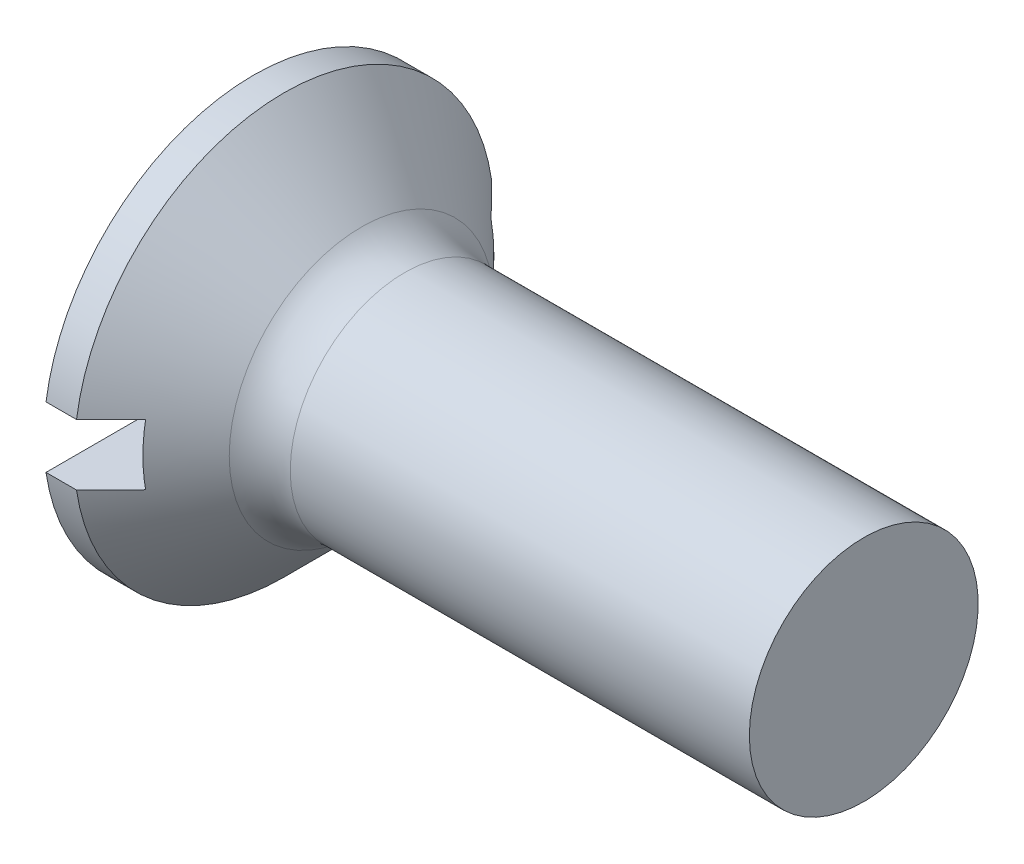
ISO-10303-21;
HEADER;
FILE_DESCRIPTION(('STEP AP214'),'2;1');
FILE_NAME('part.step','',(''),(''),'','','');
FILE_SCHEMA(('AUTOMOTIVE_DESIGN { 1 0 10303 214 1 1 1 1 }'));
ENDSEC;
DATA;
#1=APPLICATION_CONTEXT('core data for automotive mechanical design processes');
#2=APPLICATION_PROTOCOL_DEFINITION('international standard','automotive_design',2000,#1);
#3=PRODUCT_CONTEXT('',#1,'mechanical');
#4=PRODUCT('Part','Part','',(#3));
#5=PRODUCT_RELATED_PRODUCT_CATEGORY('part','',(#4));
#6=PRODUCT_DEFINITION_FORMATION('','',#4);
#7=PRODUCT_DEFINITION_CONTEXT('part definition',#1,'design');
#8=PRODUCT_DEFINITION('design','',#6,#7);
#9=PRODUCT_DEFINITION_SHAPE('','',#8);
#10=(LENGTH_UNIT() NAMED_UNIT(*) SI_UNIT(.MILLI.,.METRE.));
#11=(NAMED_UNIT(*) PLANE_ANGLE_UNIT() SI_UNIT($,.RADIAN.));
#12=(NAMED_UNIT(*) SI_UNIT($,.STERADIAN.) SOLID_ANGLE_UNIT());
#13=UNCERTAINTY_MEASURE_WITH_UNIT(LENGTH_MEASURE(1.E-05),#10,'distance_accuracy_value','');
#14=(GEOMETRIC_REPRESENTATION_CONTEXT(3) GLOBAL_UNCERTAINTY_ASSIGNED_CONTEXT((#13)) GLOBAL_UNIT_ASSIGNED_CONTEXT((#10,
#11,#12)) REPRESENTATION_CONTEXT('',''));
#15=CARTESIAN_POINT('',(0.,0.,0.));
#16=DIRECTION('',(0.,0.,1.));
#17=DIRECTION('',(1.,0.,0.));
#18=AXIS2_PLACEMENT_3D('',#15,#16,#17);
#19=CARTESIAN_POINT('',(-6.34999999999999,0.,0.));
#20=DIRECTION('',(-1.,0.,0.));
#21=DIRECTION('',(0.,0.,1.));
#22=AXIS2_PLACEMENT_3D('',#19,#20,#21);
#23=CYLINDRICAL_SURFACE('',#22,2.75);
#24=DIRECTION('',(-1.,0.,0.));
#25=VECTOR('',#24,1.);
#26=CARTESIAN_POINT('',(-6.34999999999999,0.4,-2.72075357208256));
#27=LINE('',#26,#25);
#28=CARTESIAN_POINT('',(0.,0.4,-2.72075357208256));
#29=VERTEX_POINT('',#28);
#30=CARTESIAN_POINT('',(0.400000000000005,0.4,-2.72075357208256));
#31=VERTEX_POINT('',#30);
#32=EDGE_CURVE('E56',#29,#31,#27,.F.);
#33=ORIENTED_EDGE('',*,*,#32,.F.);
#34=CARTESIAN_POINT('',(0.,0.,0.));
#35=DIRECTION('',(-1.,0.,0.));
#36=DIRECTION('',(0.,0.,1.));
#37=AXIS2_PLACEMENT_3D('',#34,#35,#36);
#38=CIRCLE('',#37,2.75);
#39=CARTESIAN_POINT('',(0.,0.4,2.72075357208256));
#40=VERTEX_POINT('',#39);
#41=EDGE_CURVE('E104',#40,#29,#38,.T.);
#42=ORIENTED_EDGE('',*,*,#41,.F.);
#43=DIRECTION('',(-1.,0.,0.));
#44=VECTOR('',#43,1.);
#45=CARTESIAN_POINT('',(-6.34999999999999,0.4,2.72075357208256));
#46=LINE('',#45,#44);
#47=CARTESIAN_POINT('',(0.400000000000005,0.4,2.72075357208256));
#48=VERTEX_POINT('',#47);
#49=EDGE_CURVE('E161',#48,#40,#46,.T.);
#50=ORIENTED_EDGE('',*,*,#49,.F.);
#51=CARTESIAN_POINT('',(0.400000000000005,0.,0.));
#52=DIRECTION('',(-1.,0.,0.));
#53=DIRECTION('',(0.,0.,1.));
#54=AXIS2_PLACEMENT_3D('',#51,#52,#53);
#55=CIRCLE('',#54,2.75);
#56=EDGE_CURVE('E113',#48,#31,#55,.T.);
#57=ORIENTED_EDGE('',*,*,#56,.T.);
#58=EDGE_LOOP('',(#33,#42,#50,#57));
#59=FACE_BOUND('',#58,.T.);
#60=ADVANCED_FACE('F33',(#59),#23,.T.);
#61=CARTESIAN_POINT('',(0.,0.,0.));
#62=DIRECTION('',(-1.,0.,0.));
#63=DIRECTION('',(0.,0.,1.));
#64=AXIS2_PLACEMENT_3D('',#61,#62,#63);
#65=PLANE('',#64);
#66=DIRECTION('',(0.,0.,-1.));
#67=VECTOR('',#66,1.);
#68=CARTESIAN_POINT('',(0.,0.4,0.));
#69=LINE('',#68,#67);
#70=EDGE_CURVE('E91',#40,#29,#69,.T.);
#71=ORIENTED_EDGE('',*,*,#70,.F.);
#72=ORIENTED_EDGE('',*,*,#41,.T.);
#73=EDGE_LOOP('',(#71,#72));
#74=FACE_BOUND('',#73,.T.);
#75=ADVANCED_FACE('F167',(#74),#65,.T.);
#76=CARTESIAN_POINT('',(8.,1.5,0.));
#77=DIRECTION('',(1.,0.,0.));
#78=DIRECTION('',(0.,0.,-1.));
#79=AXIS2_PLACEMENT_3D('',#76,#77,#78);
#80=PLANE('',#79);
#81=CARTESIAN_POINT('',(8.,0.,0.));
#82=DIRECTION('',(-1.,0.,0.));
#83=DIRECTION('',(0.,0.,1.));
#84=AXIS2_PLACEMENT_3D('',#81,#82,#83);
#85=CIRCLE('',#84,1.5);
#86=CARTESIAN_POINT('',(8.,0.,1.5));
#87=VERTEX_POINT('',#86);
#88=EDGE_CURVE('E114',#87,#87,#85,.T.);
#89=ORIENTED_EDGE('',*,*,#88,.F.);
#90=EDGE_LOOP('',(#89));
#91=FACE_BOUND('',#90,.T.);
#92=ADVANCED_FACE('F169',(#91),#80,.T.);
#93=CARTESIAN_POINT('',(-6.34999999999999,0.,0.));
#94=DIRECTION('',(-1.,0.,0.));
#95=DIRECTION('',(0.,0.,1.));
#96=AXIS2_PLACEMENT_3D('',#93,#94,#95);
#97=CYLINDRICAL_SURFACE('',#96,1.5);
#98=CARTESIAN_POINT('',(1.98137084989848,0.,0.));
#99=DIRECTION('',(-1.,0.,0.));
#100=DIRECTION('',(0.,0.,1.));
#101=AXIS2_PLACEMENT_3D('',#98,#99,#100);
#102=CIRCLE('',#101,1.5);
#103=CARTESIAN_POINT('',(1.98137084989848,0.,1.5));
#104=VERTEX_POINT('',#103);
#105=EDGE_CURVE('E92',#104,#104,#102,.F.);
#106=ORIENTED_EDGE('',*,*,#105,.T.);
#107=EDGE_LOOP('',(#106));
#108=FACE_BOUND('',#107,.T.);
#109=ORIENTED_EDGE('',*,*,#88,.T.);
#110=EDGE_LOOP('',(#109));
#111=FACE_BOUND('',#110,.T.);
#112=ADVANCED_FACE('F174',(#108,#111),#97,.T.);
#113=CARTESIAN_POINT('',(0.400000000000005,0.,0.));
#114=DIRECTION('',(-1.,0.,0.));
#115=DIRECTION('',(0.,0.,1.));
#116=AXIS2_PLACEMENT_3D('',#113,#114,#115);
#117=CONICAL_SURFACE('',#116,2.75,0.78539816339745);
#118=CARTESIAN_POINT('',(-2.91122703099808,0.399999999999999,-6.04801398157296));
#119=CARTESIAN_POINT('',(-2.70333669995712,0.399999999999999,-5.83966573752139));
#120=CARTESIAN_POINT('',(-2.49546630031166,0.399999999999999,-5.63129758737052));
#121=CARTESIAN_POINT('',(-2.07978706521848,0.399999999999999,-5.2144912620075));
#122=CARTESIAN_POINT('',(-1.87197823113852,0.399999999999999,-5.00605308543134));
#123=CARTESIAN_POINT('',(-1.45635477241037,0.399999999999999,-4.58898711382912));
#124=CARTESIAN_POINT('',(-1.2485401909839,0.399999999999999,-4.38035927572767));
#125=CARTESIAN_POINT('',(-0.833054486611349,0.399999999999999,-3.96296915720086));
#126=CARTESIAN_POINT('',(-0.625383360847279,0.399999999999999,-3.75420687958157));
#127=CARTESIAN_POINT('',(-0.208177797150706,0.399999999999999,-3.33435396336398));
#128=CARTESIAN_POINT('',(0.00135434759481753,0.4,-3.12326104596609));
#129=CARTESIAN_POINT('',(0.420030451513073,0.4,-2.70066518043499));
#130=CARTESIAN_POINT('',(0.629174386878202,0.4,-2.48916220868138));
#131=CARTESIAN_POINT('',(0.942224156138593,0.4,-2.1713129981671));
#132=CARTESIAN_POINT('',(1.04644766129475,0.4,-2.06527989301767));
#133=CARTESIAN_POINT('',(1.25455725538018,0.4,-1.85287805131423));
#134=CARTESIAN_POINT('',(1.35844333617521,0.4,-1.7465093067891));
#135=CARTESIAN_POINT('',(1.56564763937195,0.4,-1.53324094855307));
#136=CARTESIAN_POINT('',(1.66896592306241,0.4,-1.42634139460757));
#137=CARTESIAN_POINT('',(1.82313895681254,0.4,-1.26522565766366));
#138=CARTESIAN_POINT('',(1.87439491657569,0.4,-1.21139372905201));
#139=CARTESIAN_POINT('',(1.9765104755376,0.4,-1.10335558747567));
#140=CARTESIAN_POINT('',(2.02737008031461,0.4,-1.04914937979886));
#141=CARTESIAN_POINT('',(2.10536761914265,0.4,-0.965078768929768));
#142=CARTESIAN_POINT('',(2.13272119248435,0.4,-0.935414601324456));
#143=CARTESIAN_POINT('',(2.18719151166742,0.4,-0.875868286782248));
#144=CARTESIAN_POINT('',(2.21430825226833,0.4,-0.845986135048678));
#145=CARTESIAN_POINT('',(2.26822565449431,0.4,-0.785940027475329));
#146=CARTESIAN_POINT('',(2.29502633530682,0.4,-0.755776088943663));
#147=CARTESIAN_POINT('',(2.34818681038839,0.4,-0.695065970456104));
#148=CARTESIAN_POINT('',(2.37454662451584,0.4,-0.664519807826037));
#149=CARTESIAN_POINT('',(2.43976155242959,0.4,-0.587422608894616));
#150=CARTESIAN_POINT('',(2.4782379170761,0.4,-0.540543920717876));
#151=CARTESIAN_POINT('',(2.53401321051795,0.4,-0.468681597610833));
#152=CARTESIAN_POINT('',(2.55228877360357,0.4,-0.444459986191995));
#153=CARTESIAN_POINT('',(2.5878711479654,0.4,-0.39531915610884));
#154=CARTESIAN_POINT('',(2.60517823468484,0.4,-0.370400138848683));
#155=CARTESIAN_POINT('',(2.64157672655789,0.4,-0.314684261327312));
#156=CARTESIAN_POINT('',(2.66036306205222,0.4,-0.28368484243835));
#157=CARTESIAN_POINT('',(2.69440764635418,0.4,-0.219761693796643));
#158=CARTESIAN_POINT('',(2.70967206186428,0.4,-0.186841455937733));
#159=CARTESIAN_POINT('',(2.73016014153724,0.4,-0.129375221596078));
#160=CARTESIAN_POINT('',(2.73703138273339,0.4,-0.105439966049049));
#161=CARTESIAN_POINT('',(2.74668434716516,0.4,-0.0567945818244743));
#162=CARTESIAN_POINT('',(2.74948035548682,0.4,-0.0320874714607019));
#163=CARTESIAN_POINT('',(2.75038742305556,0.4,0.0175418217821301));
#164=CARTESIAN_POINT('',(2.74847509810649,0.4,0.0424644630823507));
#165=CARTESIAN_POINT('',(2.7403655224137,0.4,0.0916234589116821));
#166=CARTESIAN_POINT('',(2.73415677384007,0.4,0.115857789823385));
#167=CARTESIAN_POINT('',(2.71827371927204,0.4,0.164097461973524));
#168=CARTESIAN_POINT('',(2.70848082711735,0.4,0.188061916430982));
#169=CARTESIAN_POINT('',(2.68657810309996,0.4,0.234925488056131));
#170=CARTESIAN_POINT('',(2.67446406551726,0.4,0.257822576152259));
#171=CARTESIAN_POINT('',(2.64859519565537,0.4,0.302903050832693));
#172=CARTESIAN_POINT('',(2.63482775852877,0.4,0.325079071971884));
#173=CARTESIAN_POINT('',(2.60624001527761,0.4,0.368705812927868));
#174=CARTESIAN_POINT('',(2.59142061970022,0.4,0.390157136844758));
#175=CARTESIAN_POINT('',(2.54324495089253,0.4,0.457380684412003));
#176=CARTESIAN_POINT('',(2.5085311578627,0.4,0.502172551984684));
#177=CARTESIAN_POINT('',(2.4373574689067,0.4,0.590355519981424));
#178=CARTESIAN_POINT('',(2.40089644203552,0.4,0.633745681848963));
#179=CARTESIAN_POINT('',(2.32688330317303,0.4,0.719722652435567));
#180=CARTESIAN_POINT('',(2.28932931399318,0.4,0.762307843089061));
#181=CARTESIAN_POINT('',(2.21358878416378,0.4,0.846885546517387));
#182=CARTESIAN_POINT('',(2.17540243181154,0.4,0.888878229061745));
#183=CARTESIAN_POINT('',(2.06044068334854,0.4,1.01402227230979));
#184=CARTESIAN_POINT('',(1.98303698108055,0.4,1.09659540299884));
#185=CARTESIAN_POINT('',(1.82747335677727,0.4,1.26085212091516));
#186=CARTESIAN_POINT('',(1.74931433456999,0.4,1.34253656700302));
#187=CARTESIAN_POINT('',(1.59286602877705,0.4,1.50504082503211));
#188=CARTESIAN_POINT('',(1.51457909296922,0.4,1.58586289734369));
#189=CARTESIAN_POINT('',(1.35769196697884,0.4,1.74720261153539));
#190=CARTESIAN_POINT('',(1.27909177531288,0.4,1.82772025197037));
#191=CARTESIAN_POINT('',(1.04297819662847,0.4,2.06897290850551));
#192=CARTESIAN_POINT('',(0.885154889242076,0.4,2.22940447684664));
#193=CARTESIAN_POINT('',(0.569022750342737,0.4,2.54992542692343));
#194=CARTESIAN_POINT('',(0.410713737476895,0.4,2.71001462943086));
#195=CARTESIAN_POINT('',(0.093846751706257,0.4,3.02994348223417));
#196=CARTESIAN_POINT('',(-0.0647112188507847,0.4,3.18978313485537));
#197=CARTESIAN_POINT('',(-0.540591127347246,0.4,3.66904928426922));
#198=CARTESIAN_POINT('',(-0.858143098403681,0.400000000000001,3.98824727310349));
#199=CARTESIAN_POINT('',(-1.49349686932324,0.400000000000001,4.62632608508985));
#200=CARTESIAN_POINT('',(-1.81129863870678,0.400000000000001,4.94520693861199));
#201=CARTESIAN_POINT('',(-2.25950055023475,0.400000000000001,5.39470040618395));
#202=CARTESIAN_POINT('',(-2.38983276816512,0.400000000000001,5.5253807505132));
#203=CARTESIAN_POINT('',(-2.65051602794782,0.400000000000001,5.78671502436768));
#204=CARTESIAN_POINT('',(-2.78086706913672,0.400000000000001,5.91736895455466));
#205=CARTESIAN_POINT('',(-2.91122703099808,0.400000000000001,6.04801398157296));
#206=B_SPLINE_CURVE_WITH_KNOTS('',3,(#118,#119,#120,#121,#122,#123,#124,#125,#126,#127,#128,
#129,#130,#131,#132,#133,#134,#135,#136,#137,#138,#139,#140,#141,#142,#143,#144,#145,#146,#147,
#148,#149,#150,#151,#152,#153,#154,#155,#156,#157,#158,#159,#160,#161,#162,#163,#164,#165,#166,
#167,#168,#169,#170,#171,#172,#173,#174,#175,#176,#177,#178,#179,#180,#181,#182,#183,#184,#185,
#186,#187,#188,#189,#190,#191,#192,#193,#194,#195,#196,#197,#198,#199,#200,#201,#202,#203,#204,
#205),.UNSPECIFIED.,.F.,.F.,(4,2,2,2,2,2,2,2,2,2,2,2,2,2,2,2,2,2,2,2,2,2,2,2,2,2,2,2,2,2,2,2,2,
2,2,2,2,2,2,2,2,2,2,4),(0.,0.882975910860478,1.76597015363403,2.64937958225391,3.53277113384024,
4.42505762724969,5.31739714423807,5.76343472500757,6.20948297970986,6.65548210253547,
6.87847301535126,7.10146078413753,7.22251193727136,7.34356576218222,7.46461219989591,
7.58565317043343,7.7675312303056,7.85854400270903,7.94953075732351,8.05816632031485,
8.16661019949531,8.24105170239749,8.31523162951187,8.38978071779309,8.46453008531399,
8.54201686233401,8.61964538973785,8.69790858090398,8.77610483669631,8.94600506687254,
9.11601679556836,9.28634010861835,9.45661358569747,9.79613758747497,10.1352975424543,
10.4728599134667,10.8104238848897,11.4855651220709,12.1610000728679,12.8364286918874,
14.1871833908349,15.5377930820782,16.0914848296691,16.6451603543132),.UNSPECIFIED.);
#207=CARTESIAN_POINT('',(0.85,0.4,-2.26495033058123));
#208=VERTEX_POINT('',#207);
#209=EDGE_CURVE('E105',#31,#208,#206,.T.);
#210=ORIENTED_EDGE('',*,*,#209,.F.);
#211=ORIENTED_EDGE('',*,*,#56,.F.);
#212=CARTESIAN_POINT('',(0.85,0.4,2.26495033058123));
#213=VERTEX_POINT('',#212);
#214=EDGE_CURVE('E109',#213,#48,#206,.T.);
#215=ORIENTED_EDGE('',*,*,#214,.F.);
#216=CARTESIAN_POINT('',(0.85,0.,0.));
#217=DIRECTION('',(-1.,0.,0.));
#218=DIRECTION('',(0.,0.,1.));
#219=AXIS2_PLACEMENT_3D('',#216,#217,#218);
#220=CIRCLE('',#219,2.3);
#221=CARTESIAN_POINT('',(0.85,-0.400000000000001,2.26495033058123));
#222=VERTEX_POINT('',#221);
#223=EDGE_CURVE('E37',#213,#222,#220,.F.);
#224=ORIENTED_EDGE('',*,*,#223,.T.);
#225=CARTESIAN_POINT('',(-2.91122703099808,-0.400000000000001,6.04801398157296));
#226=CARTESIAN_POINT('',(-2.70333669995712,-0.400000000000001,5.83966573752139));
#227=CARTESIAN_POINT('',(-2.49546630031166,-0.400000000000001,5.63129758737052));
#228=CARTESIAN_POINT('',(-2.07978706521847,-0.400000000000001,5.2144912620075));
#229=CARTESIAN_POINT('',(-1.87197823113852,-0.400000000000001,5.00605308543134));
#230=CARTESIAN_POINT('',(-1.45635477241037,-0.400000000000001,4.58898711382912));
#231=CARTESIAN_POINT('',(-1.2485401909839,-0.400000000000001,4.38035927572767));
#232=CARTESIAN_POINT('',(-0.833054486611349,-0.400000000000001,3.96296915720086));
#233=CARTESIAN_POINT('',(-0.625383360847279,-0.400000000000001,3.75420687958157));
#234=CARTESIAN_POINT('',(-0.208177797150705,-0.400000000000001,3.33435396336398));
#235=CARTESIAN_POINT('',(0.00135434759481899,-0.400000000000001,3.12326104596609));
#236=CARTESIAN_POINT('',(0.420030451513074,-0.400000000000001,2.70066518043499));
#237=CARTESIAN_POINT('',(0.629174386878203,-0.400000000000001,2.48916220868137));
#238=CARTESIAN_POINT('',(0.942224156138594,-0.400000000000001,2.1713129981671));
#239=CARTESIAN_POINT('',(1.04644766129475,-0.400000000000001,2.06527989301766));
#240=CARTESIAN_POINT('',(1.25455725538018,-0.400000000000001,1.85287805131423));
#241=CARTESIAN_POINT('',(1.35844333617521,-0.400000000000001,1.7465093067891));
#242=CARTESIAN_POINT('',(1.56564763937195,-0.400000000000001,1.53324094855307));
#243=CARTESIAN_POINT('',(1.66896592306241,-0.400000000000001,1.42634139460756));
#244=CARTESIAN_POINT('',(1.82313895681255,-0.400000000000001,1.26522565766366));
#245=CARTESIAN_POINT('',(1.87439491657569,-0.400000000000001,1.211393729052));
#246=CARTESIAN_POINT('',(1.97651047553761,-0.400000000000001,1.10335558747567));
#247=CARTESIAN_POINT('',(2.02737008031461,-0.400000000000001,1.04914937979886));
#248=CARTESIAN_POINT('',(2.10536761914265,-0.400000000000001,0.965078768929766));
#249=CARTESIAN_POINT('',(2.13272119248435,-0.400000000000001,0.935414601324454));
#250=CARTESIAN_POINT('',(2.18719151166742,-0.400000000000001,0.875868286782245));
#251=CARTESIAN_POINT('',(2.21430825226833,-0.400000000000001,0.845986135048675));
#252=CARTESIAN_POINT('',(2.26822565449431,-0.400000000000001,0.785940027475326));
#253=CARTESIAN_POINT('',(2.29502633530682,-0.400000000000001,0.755776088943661));
#254=CARTESIAN_POINT('',(2.3481868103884,-0.400000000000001,0.695065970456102));
#255=CARTESIAN_POINT('',(2.37454662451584,-0.400000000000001,0.664519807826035));
#256=CARTESIAN_POINT('',(2.43976155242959,-0.400000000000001,0.587422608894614));
#257=CARTESIAN_POINT('',(2.4782379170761,-0.400000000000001,0.540543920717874));
#258=CARTESIAN_POINT('',(2.53401321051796,-0.400000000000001,0.468681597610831));
#259=CARTESIAN_POINT('',(2.55228877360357,-0.400000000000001,0.444459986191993));
#260=CARTESIAN_POINT('',(2.5878711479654,-0.400000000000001,0.395319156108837));
#261=CARTESIAN_POINT('',(2.60517823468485,-0.400000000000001,0.37040013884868));
#262=CARTESIAN_POINT('',(2.64157672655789,-0.400000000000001,0.314684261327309));
#263=CARTESIAN_POINT('',(2.66036306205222,-0.400000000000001,0.283684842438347));
#264=CARTESIAN_POINT('',(2.69440764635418,-0.400000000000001,0.219761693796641));
#265=CARTESIAN_POINT('',(2.70967206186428,-0.400000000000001,0.186841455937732));
#266=CARTESIAN_POINT('',(2.73016014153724,-0.400000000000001,0.129375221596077));
#267=CARTESIAN_POINT('',(2.73703138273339,-0.400000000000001,0.105439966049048));
#268=CARTESIAN_POINT('',(2.74668434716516,-0.400000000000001,0.056794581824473));
#269=CARTESIAN_POINT('',(2.74948035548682,-0.400000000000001,0.0320874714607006));
#270=CARTESIAN_POINT('',(2.75038742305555,-0.400000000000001,-0.0175418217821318));
#271=CARTESIAN_POINT('',(2.74847509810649,-0.400000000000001,-0.0424644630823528));
#272=CARTESIAN_POINT('',(2.7403655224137,-0.400000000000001,-0.0916234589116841));
#273=CARTESIAN_POINT('',(2.73415677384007,-0.400000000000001,-0.115857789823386));
#274=CARTESIAN_POINT('',(2.71827371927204,-0.400000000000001,-0.164097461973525));
#275=CARTESIAN_POINT('',(2.70848082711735,-0.400000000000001,-0.188061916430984));
#276=CARTESIAN_POINT('',(2.68657810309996,-0.400000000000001,-0.234925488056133));
#277=CARTESIAN_POINT('',(2.67446406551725,-0.400000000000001,-0.257822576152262));
#278=CARTESIAN_POINT('',(2.64859519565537,-0.400000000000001,-0.302903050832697));
#279=CARTESIAN_POINT('',(2.63482775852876,-0.400000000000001,-0.325079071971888));
#280=CARTESIAN_POINT('',(2.60624001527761,-0.400000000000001,-0.368705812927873));
#281=CARTESIAN_POINT('',(2.59142061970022,-0.400000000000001,-0.390157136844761));
#282=CARTESIAN_POINT('',(2.54324495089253,-0.400000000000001,-0.457380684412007));
#283=CARTESIAN_POINT('',(2.5085311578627,-0.400000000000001,-0.502172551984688));
#284=CARTESIAN_POINT('',(2.43735746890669,-0.400000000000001,-0.590355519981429));
#285=CARTESIAN_POINT('',(2.40089644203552,-0.400000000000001,-0.633745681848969));
#286=CARTESIAN_POINT('',(2.32688330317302,-0.400000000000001,-0.719722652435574));
#287=CARTESIAN_POINT('',(2.28932931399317,-0.400000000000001,-0.762307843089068));
#288=CARTESIAN_POINT('',(2.21358878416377,-0.400000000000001,-0.846885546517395));
#289=CARTESIAN_POINT('',(2.17540243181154,-0.400000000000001,-0.888878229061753));
#290=CARTESIAN_POINT('',(2.06044068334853,-0.400000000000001,-1.01402227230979));
#291=CARTESIAN_POINT('',(1.98303698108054,-0.400000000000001,-1.09659540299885));
#292=CARTESIAN_POINT('',(1.82747335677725,-0.400000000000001,-1.26085212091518));
#293=CARTESIAN_POINT('',(1.74931433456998,-0.400000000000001,-1.34253656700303));
#294=CARTESIAN_POINT('',(1.59286602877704,-0.400000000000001,-1.50504082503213));
#295=CARTESIAN_POINT('',(1.51457909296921,-0.400000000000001,-1.5858628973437));
#296=CARTESIAN_POINT('',(1.35769196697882,-0.400000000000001,-1.74720261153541));
#297=CARTESIAN_POINT('',(1.27909177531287,-0.400000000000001,-1.82772025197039));
#298=CARTESIAN_POINT('',(1.04297819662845,-0.400000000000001,-2.06897290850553));
#299=CARTESIAN_POINT('',(0.885154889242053,-0.400000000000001,-2.22940447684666));
#300=CARTESIAN_POINT('',(0.56902275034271,-0.400000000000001,-2.54992542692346));
#301=CARTESIAN_POINT('',(0.410713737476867,-0.400000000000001,-2.71001462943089));
#302=CARTESIAN_POINT('',(0.0938467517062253,-0.400000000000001,-3.0299434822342));
#303=CARTESIAN_POINT('',(-0.0647112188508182,-0.400000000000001,-3.1897831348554));
#304=CARTESIAN_POINT('',(-0.540591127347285,-0.400000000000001,-3.66904928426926));
#305=CARTESIAN_POINT('',(-0.858143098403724,-0.400000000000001,-3.98824727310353));
#306=CARTESIAN_POINT('',(-1.49349686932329,-0.400000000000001,-4.62632608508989));
#307=CARTESIAN_POINT('',(-1.81129863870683,-0.400000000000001,-4.94520693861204));
#308=CARTESIAN_POINT('',(-2.25950055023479,-0.400000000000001,-5.394700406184));
#309=CARTESIAN_POINT('',(-2.38983276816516,-0.400000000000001,-5.52538075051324));
#310=CARTESIAN_POINT('',(-2.65051602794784,-0.400000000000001,-5.7867150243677));
#311=CARTESIAN_POINT('',(-2.78086706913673,-0.400000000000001,-5.91736895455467));
#312=CARTESIAN_POINT('',(-2.91122703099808,-0.400000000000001,-6.04801398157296));
#313=B_SPLINE_CURVE_WITH_KNOTS('',3,(#225,#226,#227,#228,#229,#230,#231,#232,#233,#234,#235,
#236,#237,#238,#239,#240,#241,#242,#243,#244,#245,#246,#247,#248,#249,#250,#251,#252,#253,#254,
#255,#256,#257,#258,#259,#260,#261,#262,#263,#264,#265,#266,#267,#268,#269,#270,#271,#272,#273,
#274,#275,#276,#277,#278,#279,#280,#281,#282,#283,#284,#285,#286,#287,#288,#289,#290,#291,#292,
#293,#294,#295,#296,#297,#298,#299,#300,#301,#302,#303,#304,#305,#306,#307,#308,#309,#310,#311,
#312),.UNSPECIFIED.,.F.,.F.,(4,2,2,2,2,2,2,2,2,2,2,2,2,2,2,2,2,2,2,2,2,2,2,2,2,2,2,2,2,2,2,2,2,
2,2,2,2,2,2,2,2,2,2,4),(0.,0.882975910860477,1.76597015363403,2.6493795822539,3.53277113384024,
4.42505762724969,5.31739714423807,5.76343472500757,6.20948297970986,6.65548210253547,
6.87847301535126,7.10146078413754,7.22251193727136,7.34356576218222,7.46461219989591,
7.58565317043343,7.7675312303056,7.85854400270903,7.94953075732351,8.05816632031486,
8.16661019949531,8.24105170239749,8.31523162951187,8.38978071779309,8.46453008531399,
8.542016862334,8.61964538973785,8.69790858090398,8.77610483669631,8.94600506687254,
9.11601679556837,9.28634010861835,9.45661358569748,9.79613758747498,10.1352975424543,
10.4728599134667,10.8104238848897,11.4855651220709,12.1610000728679,12.8364286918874,
14.1871833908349,15.5377930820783,16.0914848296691,16.6451603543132),.UNSPECIFIED.);
#314=CARTESIAN_POINT('',(0.400000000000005,-0.400000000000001,2.72075357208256));
#315=VERTEX_POINT('',#314);
#316=EDGE_CURVE('E100',#315,#222,#313,.T.);
#317=ORIENTED_EDGE('',*,*,#316,.F.);
#318=CARTESIAN_POINT('',(0.400000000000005,-0.400000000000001,-2.72075357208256));
#319=VERTEX_POINT('',#318);
#320=EDGE_CURVE('E99',#319,#315,#55,.T.);
#321=ORIENTED_EDGE('',*,*,#320,.F.);
#322=CARTESIAN_POINT('',(0.85,-0.400000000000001,-2.26495033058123));
#323=VERTEX_POINT('',#322);
#324=EDGE_CURVE('E101',#323,#319,#313,.T.);
#325=ORIENTED_EDGE('',*,*,#324,.F.);
#326=EDGE_CURVE('E11',#323,#208,#220,.F.);
#327=ORIENTED_EDGE('',*,*,#326,.T.);
#328=EDGE_LOOP('',(#210,#211,#215,#224,#317,#321,#325,#327));
#329=FACE_BOUND('',#328,.T.);
#330=CARTESIAN_POINT('',(1.41568542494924,0.,0.));
#331=DIRECTION('',(-1.,0.,0.));
#332=DIRECTION('',(0.,0.,1.));
#333=AXIS2_PLACEMENT_3D('',#330,#331,#332);
#334=CIRCLE('',#333,1.73431457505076);
#335=CARTESIAN_POINT('',(1.41568542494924,0.,1.73431457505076));
#336=VERTEX_POINT('',#335);
#337=EDGE_CURVE('E117',#336,#336,#334,.T.);
#338=ORIENTED_EDGE('',*,*,#337,.T.);
#339=EDGE_LOOP('',(#338));
#340=FACE_BOUND('',#339,.T.);
#341=ADVANCED_FACE('F125',(#329,#340),#117,.T.);
#342=DIRECTION('',(-1.,0.,0.));
#343=VECTOR('',#342,1.);
#344=CARTESIAN_POINT('',(-6.34999999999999,-0.400000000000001,2.72075357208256));
#345=LINE('',#344,#343);
#346=CARTESIAN_POINT('',(0.,-0.400000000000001,2.72075357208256));
#347=VERTEX_POINT('',#346);
#348=EDGE_CURVE('E86',#347,#315,#345,.F.);
#349=ORIENTED_EDGE('',*,*,#348,.F.);
#350=CARTESIAN_POINT('',(0.,-0.400000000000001,-2.72075357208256));
#351=VERTEX_POINT('',#350);
#352=EDGE_CURVE('E97',#351,#347,#38,.T.);
#353=ORIENTED_EDGE('',*,*,#352,.F.);
#354=DIRECTION('',(-1.,0.,0.));
#355=VECTOR('',#354,1.);
#356=CARTESIAN_POINT('',(-6.34999999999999,-0.400000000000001,-2.72075357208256));
#357=LINE('',#356,#355);
#358=EDGE_CURVE('E48',#319,#351,#357,.T.);
#359=ORIENTED_EDGE('',*,*,#358,.F.);
#360=ORIENTED_EDGE('',*,*,#320,.T.);
#361=EDGE_LOOP('',(#349,#353,#359,#360));
#362=FACE_BOUND('',#361,.T.);
#363=ADVANCED_FACE('F96',(#362),#23,.T.);
#364=DIRECTION('',(0.,0.,1.));
#365=VECTOR('',#364,1.);
#366=CARTESIAN_POINT('',(0.,-0.400000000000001,0.));
#367=LINE('',#366,#365);
#368=EDGE_CURVE('E83',#351,#347,#367,.T.);
#369=ORIENTED_EDGE('',*,*,#368,.F.);
#370=ORIENTED_EDGE('',*,*,#352,.T.);
#371=EDGE_LOOP('',(#369,#370));
#372=FACE_BOUND('',#371,.T.);
#373=ADVANCED_FACE('F103',(#372),#65,.T.);
#374=CARTESIAN_POINT('',(1.98137084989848,0.,0.));
#375=DIRECTION('',(-1.,0.,0.));
#376=DIRECTION('',(0.,0.,1.));
#377=AXIS2_PLACEMENT_3D('',#374,#375,#376);
#378=TOROIDAL_SURFACE('',#377,2.3,0.8);
#379=ORIENTED_EDGE('',*,*,#105,.F.);
#380=EDGE_LOOP('',(#379));
#381=FACE_BOUND('',#380,.T.);
#382=ORIENTED_EDGE('',*,*,#337,.F.);
#383=EDGE_LOOP('',(#382));
#384=FACE_BOUND('',#383,.T.);
#385=ADVANCED_FACE('F35',(#381,#384),#378,.F.);
#386=CARTESIAN_POINT('',(0.85,0.4,2.75));
#387=DIRECTION('',(0.,1.,0.));
#388=DIRECTION('',(0.,0.,1.));
#389=AXIS2_PLACEMENT_3D('',#386,#387,#388);
#390=PLANE('',#389);
#391=ORIENTED_EDGE('',*,*,#209,.T.);
#392=DIRECTION('',(0.,0.,-1.));
#393=VECTOR('',#392,1.);
#394=CARTESIAN_POINT('',(0.85,0.4,2.75));
#395=LINE('',#394,#393);
#396=EDGE_CURVE('E133',#213,#208,#395,.T.);
#397=ORIENTED_EDGE('',*,*,#396,.F.);
#398=ORIENTED_EDGE('',*,*,#214,.T.);
#399=ORIENTED_EDGE('',*,*,#49,.T.);
#400=ORIENTED_EDGE('',*,*,#70,.T.);
#401=ORIENTED_EDGE('',*,*,#32,.T.);
#402=EDGE_LOOP('',(#391,#397,#398,#399,#400,#401));
#403=FACE_BOUND('',#402,.T.);
#404=ADVANCED_FACE('F136',(#403),#390,.F.);
#405=CARTESIAN_POINT('',(0.85,-0.400000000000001,-2.75));
#406=DIRECTION('',(0.,-1.,0.));
#407=DIRECTION('',(0.,0.,-1.));
#408=AXIS2_PLACEMENT_3D('',#405,#406,#407);
#409=PLANE('',#408);
#410=ORIENTED_EDGE('',*,*,#316,.T.);
#411=DIRECTION('',(0.,0.,1.));
#412=VECTOR('',#411,1.);
#413=CARTESIAN_POINT('',(0.85,-0.400000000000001,-2.75));
#414=LINE('',#413,#412);
#415=EDGE_CURVE('E135',#323,#222,#414,.T.);
#416=ORIENTED_EDGE('',*,*,#415,.F.);
#417=ORIENTED_EDGE('',*,*,#324,.T.);
#418=ORIENTED_EDGE('',*,*,#358,.T.);
#419=ORIENTED_EDGE('',*,*,#368,.T.);
#420=ORIENTED_EDGE('',*,*,#348,.T.);
#421=EDGE_LOOP('',(#410,#416,#417,#418,#419,#420));
#422=FACE_BOUND('',#421,.T.);
#423=ADVANCED_FACE('F85',(#422),#409,.F.);
#424=CARTESIAN_POINT('',(0.85,0.4,-2.75));
#425=DIRECTION('',(-1.,0.,0.));
#426=DIRECTION('',(0.,0.,1.));
#427=AXIS2_PLACEMENT_3D('',#424,#425,#426);
#428=PLANE('',#427);
#429=ORIENTED_EDGE('',*,*,#415,.T.);
#430=ORIENTED_EDGE('',*,*,#223,.F.);
#431=ORIENTED_EDGE('',*,*,#396,.T.);
#432=ORIENTED_EDGE('',*,*,#326,.F.);
#433=EDGE_LOOP('',(#429,#430,#431,#432));
#434=FACE_BOUND('',#433,.T.);
#435=ADVANCED_FACE('F132',(#434),#428,.T.);
#436=CLOSED_SHELL('',(#60,#75,#92,#112,#341,#363,#373,#385,#404,#423,#435));
#437=MANIFOLD_SOLID_BREP('B2',#436);
#438=ADVANCED_BREP_SHAPE_REPRESENTATION('',(#18,#437),#14);
#439=SHAPE_DEFINITION_REPRESENTATION(#9,#438);
ENDSEC;
END-ISO-10303-21;
